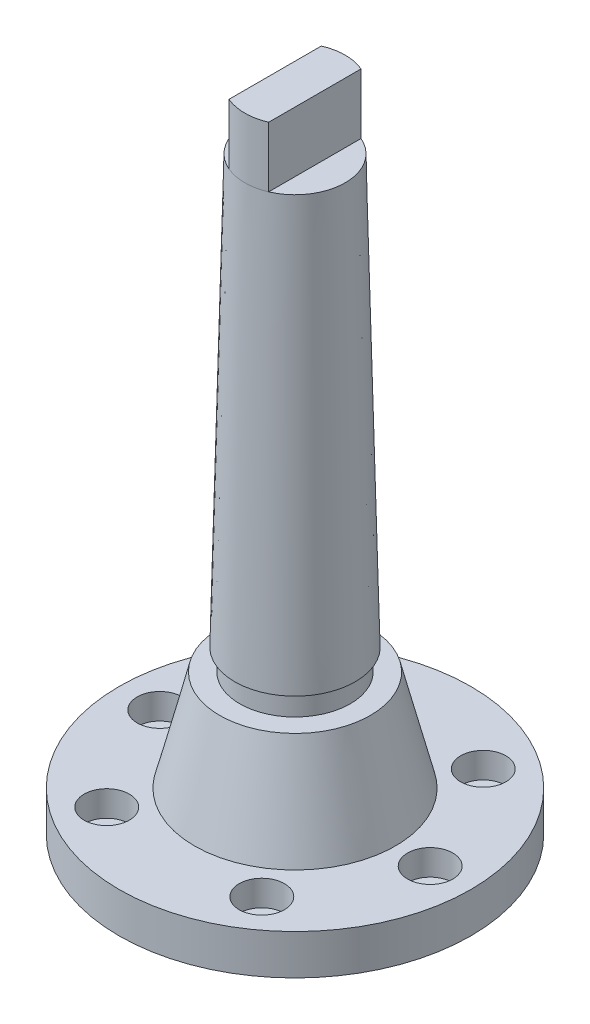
ISO-10303-21;
HEADER;
FILE_DESCRIPTION(('STEP AP214'),'2;1');
FILE_NAME('part.step','',(''),(''),'','','');
FILE_SCHEMA(('AUTOMOTIVE_DESIGN { 1 0 10303 214 1 1 1 1 }'));
ENDSEC;
DATA;
#1=APPLICATION_CONTEXT('core data for automotive mechanical design processes');
#2=APPLICATION_PROTOCOL_DEFINITION('international standard','automotive_design',2000,#1);
#3=PRODUCT_CONTEXT('',#1,'mechanical');
#4=PRODUCT('Part','Part','',(#3));
#5=PRODUCT_RELATED_PRODUCT_CATEGORY('part','',(#4));
#6=PRODUCT_DEFINITION_FORMATION('','',#4);
#7=PRODUCT_DEFINITION_CONTEXT('part definition',#1,'design');
#8=PRODUCT_DEFINITION('design','',#6,#7);
#9=PRODUCT_DEFINITION_SHAPE('','',#8);
#10=(LENGTH_UNIT() NAMED_UNIT(*) SI_UNIT(.MILLI.,.METRE.));
#11=(NAMED_UNIT(*) PLANE_ANGLE_UNIT() SI_UNIT($,.RADIAN.));
#12=(NAMED_UNIT(*) SI_UNIT($,.STERADIAN.) SOLID_ANGLE_UNIT());
#13=UNCERTAINTY_MEASURE_WITH_UNIT(LENGTH_MEASURE(1.E-05),#10,'distance_accuracy_value','');
#14=(GEOMETRIC_REPRESENTATION_CONTEXT(3) GLOBAL_UNCERTAINTY_ASSIGNED_CONTEXT((#13)) GLOBAL_UNIT_ASSIGNED_CONTEXT((#10,
#11,#12)) REPRESENTATION_CONTEXT('',''));
#15=CARTESIAN_POINT('',(0.,0.,0.));
#16=DIRECTION('',(0.,0.,1.));
#17=DIRECTION('',(1.,0.,0.));
#18=AXIS2_PLACEMENT_3D('',#15,#16,#17);
#19=CARTESIAN_POINT('',(0.,125.3,0.));
#20=DIRECTION('',(0.,1.,0.));
#21=DIRECTION('',(0.,0.,1.));
#22=AXIS2_PLACEMENT_3D('',#19,#20,#21);
#23=PLANE('',#22);
#24=DIRECTION('',(0.,0.,1.));
#25=VECTOR('',#24,1.);
#26=CARTESIAN_POINT('',(-3.95,125.3,9.18681119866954));
#27=LINE('',#26,#25);
#28=CARTESIAN_POINT('',(-3.94999934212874,125.3,-9.1868132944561));
#29=VERTEX_POINT('',#28);
#30=CARTESIAN_POINT('',(-3.95000032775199,125.3,9.18681015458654));
#31=VERTEX_POINT('',#30);
#32=EDGE_CURVE('E72',#29,#31,#27,.T.);
#33=ORIENTED_EDGE('',*,*,#32,.F.);
#34=CARTESIAN_POINT('',(0.,125.3,0.));
#35=DIRECTION('',(0.,1.,0.));
#36=DIRECTION('',(0.,0.,1.));
#37=AXIS2_PLACEMENT_3D('',#34,#35,#36);
#38=CIRCLE('',#37,10.);
#39=EDGE_CURVE('E124',#29,#31,#38,.T.);
#40=ORIENTED_EDGE('',*,*,#39,.T.);
#41=EDGE_LOOP('',(#33,#40));
#42=FACE_BOUND('',#41,.T.);
#43=ADVANCED_FACE('F45',(#42),#23,.T.);
#44=CARTESIAN_POINT('',(0.,16.,0.));
#45=DIRECTION('',(0.,1.,0.));
#46=DIRECTION('',(0.,0.,1.));
#47=AXIS2_PLACEMENT_3D('',#44,#45,#46);
#48=PLANE('',#47);
#49=CARTESIAN_POINT('',(0.,16.,0.));
#50=DIRECTION('',(0.,1.,0.));
#51=DIRECTION('',(0.,0.,1.));
#52=AXIS2_PLACEMENT_3D('',#49,#50,#51);
#53=CIRCLE('',#52,35.);
#54=CARTESIAN_POINT('',(0.,16.,35.));
#55=VERTEX_POINT('',#54);
#56=EDGE_CURVE('E335',#55,#55,#53,.T.);
#57=ORIENTED_EDGE('',*,*,#56,.T.);
#58=EDGE_LOOP('',(#57));
#59=FACE_BOUND('',#58,.T.);
#60=CARTESIAN_POINT('',(-15.4292061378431,16.,-22.0351899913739));
#61=DIRECTION('',(0.,1.,0.));
#62=DIRECTION('',(0.,0.,1.));
#63=AXIS2_PLACEMENT_3D('',#60,#61,#62);
#64=CIRCLE('',#63,4.5);
#65=CARTESIAN_POINT('',(-15.4292061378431,16.,-17.5351899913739));
#66=VERTEX_POINT('',#65);
#67=EDGE_CURVE('E265',#66,#66,#64,.T.);
#68=ORIENTED_EDGE('',*,*,#67,.F.);
#69=EDGE_LOOP('',(#68));
#70=FACE_BOUND('',#69,.T.);
#71=CARTESIAN_POINT('',(15.4292061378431,16.,-22.0351899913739));
#72=DIRECTION('',(0.,1.,0.));
#73=DIRECTION('',(0.,0.,1.));
#74=AXIS2_PLACEMENT_3D('',#71,#72,#73);
#75=CIRCLE('',#74,4.5);
#76=CARTESIAN_POINT('',(15.4292061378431,16.,-17.5351899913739));
#77=VERTEX_POINT('',#76);
#78=EDGE_CURVE('E266',#77,#77,#75,.T.);
#79=ORIENTED_EDGE('',*,*,#78,.F.);
#80=EDGE_LOOP('',(#79));
#81=FACE_BOUND('',#80,.T.);
#82=CARTESIAN_POINT('',(26.9,16.,0.));
#83=DIRECTION('',(0.,1.,0.));
#84=DIRECTION('',(0.,0.,1.));
#85=AXIS2_PLACEMENT_3D('',#82,#83,#84);
#86=CIRCLE('',#85,4.5);
#87=CARTESIAN_POINT('',(26.9,16.,4.5));
#88=VERTEX_POINT('',#87);
#89=EDGE_CURVE('E274',#88,#88,#86,.T.);
#90=ORIENTED_EDGE('',*,*,#89,.F.);
#91=EDGE_LOOP('',(#90));
#92=FACE_BOUND('',#91,.T.);
#93=CARTESIAN_POINT('',(15.4292061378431,16.,22.0351899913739));
#94=DIRECTION('',(0.,1.,0.));
#95=DIRECTION('',(0.,0.,1.));
#96=AXIS2_PLACEMENT_3D('',#93,#94,#95);
#97=CIRCLE('',#96,4.5);
#98=CARTESIAN_POINT('',(15.4292061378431,16.,26.5351899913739));
#99=VERTEX_POINT('',#98);
#100=EDGE_CURVE('E282',#99,#99,#97,.T.);
#101=ORIENTED_EDGE('',*,*,#100,.F.);
#102=EDGE_LOOP('',(#101));
#103=FACE_BOUND('',#102,.T.);
#104=CARTESIAN_POINT('',(-15.4292061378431,16.,22.0351899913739));
#105=DIRECTION('',(0.,1.,0.));
#106=DIRECTION('',(0.,0.,1.));
#107=AXIS2_PLACEMENT_3D('',#104,#105,#106);
#108=CIRCLE('',#107,4.5);
#109=CARTESIAN_POINT('',(-15.4292061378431,16.,26.5351899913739));
#110=VERTEX_POINT('',#109);
#111=EDGE_CURVE('E290',#110,#110,#108,.T.);
#112=ORIENTED_EDGE('',*,*,#111,.F.);
#113=EDGE_LOOP('',(#112));
#114=FACE_BOUND('',#113,.T.);
#115=CARTESIAN_POINT('',(-26.9,16.,0.));
#116=DIRECTION('',(0.,1.,0.));
#117=DIRECTION('',(0.,0.,1.));
#118=AXIS2_PLACEMENT_3D('',#115,#116,#117);
#119=CIRCLE('',#118,4.5);
#120=CARTESIAN_POINT('',(-26.9,16.,4.5));
#121=VERTEX_POINT('',#120);
#122=EDGE_CURVE('E258',#121,#121,#119,.T.);
#123=ORIENTED_EDGE('',*,*,#122,.F.);
#124=EDGE_LOOP('',(#123));
#125=FACE_BOUND('',#124,.T.);
#126=CARTESIAN_POINT('',(0.,16.,0.));
#127=DIRECTION('',(0.,1.,0.));
#128=DIRECTION('',(0.,0.,1.));
#129=AXIS2_PLACEMENT_3D('',#126,#127,#128);
#130=CIRCLE('',#129,20.);
#131=CARTESIAN_POINT('',(0.,16.,20.));
#132=VERTEX_POINT('',#131);
#133=EDGE_CURVE('E216',#132,#132,#130,.T.);
#134=ORIENTED_EDGE('',*,*,#133,.F.);
#135=EDGE_LOOP('',(#134));
#136=FACE_BOUND('',#135,.T.);
#137=ADVANCED_FACE('F376',(#59,#70,#81,#92,#103,#114,#125,#136),#48,.T.);
#138=CARTESIAN_POINT('',(-15.4292061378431,-0.001000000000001,-22.0351899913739));
#139=DIRECTION('',(0.,1.,0.));
#140=DIRECTION('',(0.,0.,1.));
#141=AXIS2_PLACEMENT_3D('',#138,#139,#140);
#142=CYLINDRICAL_SURFACE('',#141,2.7);
#143=CARTESIAN_POINT('',(-15.4292061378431,8.,-22.0351899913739));
#144=DIRECTION('',(0.,1.,0.));
#145=DIRECTION('',(0.,0.,1.));
#146=AXIS2_PLACEMENT_3D('',#143,#144,#145);
#147=CIRCLE('',#146,2.7);
#148=CARTESIAN_POINT('',(-15.4292061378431,8.,-19.3351899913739));
#149=VERTEX_POINT('',#148);
#150=EDGE_CURVE('E314',#149,#149,#147,.F.);
#151=ORIENTED_EDGE('',*,*,#150,.T.);
#152=EDGE_LOOP('',(#151));
#153=FACE_BOUND('',#152,.T.);
#154=CARTESIAN_POINT('',(-15.4292061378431,10.9,-22.0351899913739));
#155=DIRECTION('',(0.,1.,0.));
#156=DIRECTION('',(0.,0.,1.));
#157=AXIS2_PLACEMENT_3D('',#154,#155,#156);
#158=CIRCLE('',#157,2.7);
#159=CARTESIAN_POINT('',(-15.4292061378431,10.9,-19.3351899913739));
#160=VERTEX_POINT('',#159);
#161=EDGE_CURVE('E320',#160,#160,#158,.F.);
#162=ORIENTED_EDGE('',*,*,#161,.F.);
#163=EDGE_LOOP('',(#162));
#164=FACE_BOUND('',#163,.T.);
#165=ADVANCED_FACE('F373',(#153,#164),#142,.F.);
#166=CARTESIAN_POINT('',(15.4292061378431,-0.001000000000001,-22.0351899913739));
#167=DIRECTION('',(0.,1.,0.));
#168=DIRECTION('',(0.,0.,1.));
#169=AXIS2_PLACEMENT_3D('',#166,#167,#168);
#170=CYLINDRICAL_SURFACE('',#169,2.7);
#171=CARTESIAN_POINT('',(15.4292061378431,8.,-22.0351899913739));
#172=DIRECTION('',(0.,1.,0.));
#173=DIRECTION('',(0.,0.,1.));
#174=AXIS2_PLACEMENT_3D('',#171,#172,#173);
#175=CIRCLE('',#174,2.7);
#176=CARTESIAN_POINT('',(15.4292061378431,8.,-19.3351899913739));
#177=VERTEX_POINT('',#176);
#178=EDGE_CURVE('E324',#177,#177,#175,.F.);
#179=ORIENTED_EDGE('',*,*,#178,.T.);
#180=EDGE_LOOP('',(#179));
#181=FACE_BOUND('',#180,.T.);
#182=CARTESIAN_POINT('',(15.4292061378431,10.9,-22.0351899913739));
#183=DIRECTION('',(0.,1.,0.));
#184=DIRECTION('',(0.,0.,1.));
#185=AXIS2_PLACEMENT_3D('',#182,#183,#184);
#186=CIRCLE('',#185,2.7);
#187=CARTESIAN_POINT('',(15.4292061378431,10.9,-19.3351899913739));
#188=VERTEX_POINT('',#187);
#189=EDGE_CURVE('E364',#188,#188,#186,.F.);
#190=ORIENTED_EDGE('',*,*,#189,.F.);
#191=EDGE_LOOP('',(#190));
#192=FACE_BOUND('',#191,.T.);
#193=ADVANCED_FACE('F375',(#181,#192),#170,.F.);
#194=CARTESIAN_POINT('',(26.9,-0.001000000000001,0.));
#195=DIRECTION('',(0.,1.,0.));
#196=DIRECTION('',(0.,0.,1.));
#197=AXIS2_PLACEMENT_3D('',#194,#195,#196);
#198=CYLINDRICAL_SURFACE('',#197,2.7);
#199=CARTESIAN_POINT('',(26.9,8.,0.));
#200=DIRECTION('',(0.,1.,0.));
#201=DIRECTION('',(0.,0.,1.));
#202=AXIS2_PLACEMENT_3D('',#199,#200,#201);
#203=CIRCLE('',#202,2.7);
#204=CARTESIAN_POINT('',(26.9,8.,2.7));
#205=VERTEX_POINT('',#204);
#206=EDGE_CURVE('E328',#205,#205,#203,.F.);
#207=ORIENTED_EDGE('',*,*,#206,.T.);
#208=EDGE_LOOP('',(#207));
#209=FACE_BOUND('',#208,.T.);
#210=CARTESIAN_POINT('',(26.9,10.9,0.));
#211=DIRECTION('',(0.,1.,0.));
#212=DIRECTION('',(0.,0.,1.));
#213=AXIS2_PLACEMENT_3D('',#210,#211,#212);
#214=CIRCLE('',#213,2.7);
#215=CARTESIAN_POINT('',(26.9,10.9,2.7));
#216=VERTEX_POINT('',#215);
#217=EDGE_CURVE('E360',#216,#216,#214,.F.);
#218=ORIENTED_EDGE('',*,*,#217,.F.);
#219=EDGE_LOOP('',(#218));
#220=FACE_BOUND('',#219,.T.);
#221=ADVANCED_FACE('F383',(#209,#220),#198,.F.);
#222=CARTESIAN_POINT('',(15.4292061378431,-0.001000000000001,22.0351899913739));
#223=DIRECTION('',(0.,1.,0.));
#224=DIRECTION('',(0.,0.,1.));
#225=AXIS2_PLACEMENT_3D('',#222,#223,#224);
#226=CYLINDRICAL_SURFACE('',#225,2.7);
#227=CARTESIAN_POINT('',(15.4292061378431,8.,22.0351899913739));
#228=DIRECTION('',(0.,1.,0.));
#229=DIRECTION('',(0.,0.,1.));
#230=AXIS2_PLACEMENT_3D('',#227,#228,#229);
#231=CIRCLE('',#230,2.7);
#232=CARTESIAN_POINT('',(15.4292061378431,8.,24.7351899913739));
#233=VERTEX_POINT('',#232);
#234=EDGE_CURVE('E319',#233,#233,#231,.F.);
#235=ORIENTED_EDGE('',*,*,#234,.T.);
#236=EDGE_LOOP('',(#235));
#237=FACE_BOUND('',#236,.T.);
#238=CARTESIAN_POINT('',(15.4292061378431,10.9,22.0351899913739));
#239=DIRECTION('',(0.,1.,0.));
#240=DIRECTION('',(0.,0.,1.));
#241=AXIS2_PLACEMENT_3D('',#238,#239,#240);
#242=CIRCLE('',#241,2.7);
#243=CARTESIAN_POINT('',(15.4292061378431,10.9,24.7351899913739));
#244=VERTEX_POINT('',#243);
#245=EDGE_CURVE('E356',#244,#244,#242,.F.);
#246=ORIENTED_EDGE('',*,*,#245,.F.);
#247=EDGE_LOOP('',(#246));
#248=FACE_BOUND('',#247,.T.);
#249=ADVANCED_FACE('F559',(#237,#248),#226,.F.);
#250=CARTESIAN_POINT('',(-15.4292061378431,-0.001000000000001,22.0351899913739));
#251=DIRECTION('',(0.,1.,0.));
#252=DIRECTION('',(0.,0.,1.));
#253=AXIS2_PLACEMENT_3D('',#250,#251,#252);
#254=CYLINDRICAL_SURFACE('',#253,2.7);
#255=CARTESIAN_POINT('',(-15.4292061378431,8.,22.0351899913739));
#256=DIRECTION('',(0.,1.,0.));
#257=DIRECTION('',(0.,0.,1.));
#258=AXIS2_PLACEMENT_3D('',#255,#256,#257);
#259=CIRCLE('',#258,2.7);
#260=CARTESIAN_POINT('',(-15.4292061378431,8.,24.7351899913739));
#261=VERTEX_POINT('',#260);
#262=EDGE_CURVE('E315',#261,#261,#259,.F.);
#263=ORIENTED_EDGE('',*,*,#262,.T.);
#264=EDGE_LOOP('',(#263));
#265=FACE_BOUND('',#264,.T.);
#266=CARTESIAN_POINT('',(-15.4292061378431,10.9,22.0351899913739));
#267=DIRECTION('',(0.,1.,0.));
#268=DIRECTION('',(0.,0.,1.));
#269=AXIS2_PLACEMENT_3D('',#266,#267,#268);
#270=CIRCLE('',#269,2.7);
#271=CARTESIAN_POINT('',(-15.4292061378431,10.9,24.7351899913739));
#272=VERTEX_POINT('',#271);
#273=EDGE_CURVE('E352',#272,#272,#270,.F.);
#274=ORIENTED_EDGE('',*,*,#273,.F.);
#275=EDGE_LOOP('',(#274));
#276=FACE_BOUND('',#275,.T.);
#277=ADVANCED_FACE('F551',(#265,#276),#254,.F.);
#278=CARTESIAN_POINT('',(-26.9,-0.001000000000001,0.));
#279=DIRECTION('',(0.,1.,0.));
#280=DIRECTION('',(0.,0.,1.));
#281=AXIS2_PLACEMENT_3D('',#278,#279,#280);
#282=CYLINDRICAL_SURFACE('',#281,2.7);
#283=CARTESIAN_POINT('',(-26.9,8.,0.));
#284=DIRECTION('',(0.,1.,0.));
#285=DIRECTION('',(0.,0.,1.));
#286=AXIS2_PLACEMENT_3D('',#283,#284,#285);
#287=CIRCLE('',#286,2.7);
#288=CARTESIAN_POINT('',(-26.9,8.,2.7));
#289=VERTEX_POINT('',#288);
#290=EDGE_CURVE('E309',#289,#289,#287,.F.);
#291=ORIENTED_EDGE('',*,*,#290,.T.);
#292=EDGE_LOOP('',(#291));
#293=FACE_BOUND('',#292,.T.);
#294=CARTESIAN_POINT('',(-26.9,10.9,0.));
#295=DIRECTION('',(0.,1.,0.));
#296=DIRECTION('',(0.,0.,1.));
#297=AXIS2_PLACEMENT_3D('',#294,#295,#296);
#298=CIRCLE('',#297,2.7);
#299=CARTESIAN_POINT('',(-26.9,10.9,2.7));
#300=VERTEX_POINT('',#299);
#301=EDGE_CURVE('E305',#300,#300,#298,.F.);
#302=ORIENTED_EDGE('',*,*,#301,.F.);
#303=EDGE_LOOP('',(#302));
#304=FACE_BOUND('',#303,.T.);
#305=ADVANCED_FACE('F545',(#293,#304),#282,.F.);
#306=CARTESIAN_POINT('',(0.,8.,0.));
#307=DIRECTION('',(0.,-1.,0.));
#308=DIRECTION('',(0.,0.,-1.));
#309=AXIS2_PLACEMENT_3D('',#306,#307,#308);
#310=CYLINDRICAL_SURFACE('',#309,17.95);
#311=CARTESIAN_POINT('',(0.,8.,0.));
#312=DIRECTION('',(0.,1.,0.));
#313=DIRECTION('',(0.,0.,1.));
#314=AXIS2_PLACEMENT_3D('',#311,#312,#313);
#315=CIRCLE('',#314,17.95);
#316=CARTESIAN_POINT('',(0.,8.,17.95));
#317=VERTEX_POINT('',#316);
#318=EDGE_CURVE('E57',#317,#317,#315,.T.);
#319=ORIENTED_EDGE('',*,*,#318,.F.);
#320=EDGE_LOOP('',(#319));
#321=FACE_BOUND('',#320,.T.);
#322=CARTESIAN_POINT('',(0.,0.,0.));
#323=DIRECTION('',(0.,1.,0.));
#324=DIRECTION('',(0.,0.,1.));
#325=AXIS2_PLACEMENT_3D('',#322,#323,#324);
#326=CIRCLE('',#325,17.95);
#327=CARTESIAN_POINT('',(0.,0.,17.95));
#328=VERTEX_POINT('',#327);
#329=EDGE_CURVE('E339',#328,#328,#326,.T.);
#330=ORIENTED_EDGE('',*,*,#329,.T.);
#331=EDGE_LOOP('',(#330));
#332=FACE_BOUND('',#331,.T.);
#333=ADVANCED_FACE('F47',(#321,#332),#310,.T.);
#334=CARTESIAN_POINT('',(0.,0.,0.));
#335=DIRECTION('',(0.,1.,0.));
#336=DIRECTION('',(0.,0.,1.));
#337=AXIS2_PLACEMENT_3D('',#334,#335,#336);
#338=PLANE('',#337);
#339=ORIENTED_EDGE('',*,*,#329,.F.);
#340=EDGE_LOOP('',(#339));
#341=FACE_BOUND('',#340,.T.);
#342=ADVANCED_FACE('F531',(#341),#338,.F.);
#343=CARTESIAN_POINT('',(0.,16.,0.));
#344=DIRECTION('',(0.,-1.,0.));
#345=DIRECTION('',(0.,0.,-1.));
#346=AXIS2_PLACEMENT_3D('',#343,#344,#345);
#347=CYLINDRICAL_SURFACE('',#346,35.);
#348=ORIENTED_EDGE('',*,*,#56,.F.);
#349=EDGE_LOOP('',(#348));
#350=FACE_BOUND('',#349,.T.);
#351=CARTESIAN_POINT('',(0.,8.,0.));
#352=DIRECTION('',(0.,1.,0.));
#353=DIRECTION('',(0.,0.,1.));
#354=AXIS2_PLACEMENT_3D('',#351,#352,#353);
#355=CIRCLE('',#354,35.);
#356=CARTESIAN_POINT('',(0.,8.,35.));
#357=VERTEX_POINT('',#356);
#358=EDGE_CURVE('E313',#357,#357,#355,.T.);
#359=ORIENTED_EDGE('',*,*,#358,.T.);
#360=EDGE_LOOP('',(#359));
#361=FACE_BOUND('',#360,.T.);
#362=ADVANCED_FACE('F523',(#350,#361),#347,.T.);
#363=CARTESIAN_POINT('',(0.,8.,0.));
#364=DIRECTION('',(0.,1.,0.));
#365=DIRECTION('',(0.,0.,1.));
#366=AXIS2_PLACEMENT_3D('',#363,#364,#365);
#367=PLANE('',#366);
#368=ORIENTED_EDGE('',*,*,#290,.F.);
#369=EDGE_LOOP('',(#368));
#370=FACE_BOUND('',#369,.T.);
#371=ORIENTED_EDGE('',*,*,#262,.F.);
#372=EDGE_LOOP('',(#371));
#373=FACE_BOUND('',#372,.T.);
#374=ORIENTED_EDGE('',*,*,#234,.F.);
#375=EDGE_LOOP('',(#374));
#376=FACE_BOUND('',#375,.T.);
#377=ORIENTED_EDGE('',*,*,#206,.F.);
#378=EDGE_LOOP('',(#377));
#379=FACE_BOUND('',#378,.T.);
#380=ORIENTED_EDGE('',*,*,#178,.F.);
#381=EDGE_LOOP('',(#380));
#382=FACE_BOUND('',#381,.T.);
#383=ORIENTED_EDGE('',*,*,#150,.F.);
#384=EDGE_LOOP('',(#383));
#385=FACE_BOUND('',#384,.T.);
#386=ORIENTED_EDGE('',*,*,#318,.T.);
#387=EDGE_LOOP('',(#386));
#388=FACE_BOUND('',#387,.T.);
#389=ORIENTED_EDGE('',*,*,#358,.F.);
#390=EDGE_LOOP('',(#389));
#391=FACE_BOUND('',#390,.T.);
#392=ADVANCED_FACE('F514',(#370,#373,#376,#379,#382,#385,#388,#391),#367,.F.);
#393=CARTESIAN_POINT('',(-26.9,10.9,0.));
#394=DIRECTION('',(0.,1.,0.));
#395=DIRECTION('',(0.,0.,1.));
#396=AXIS2_PLACEMENT_3D('',#393,#394,#395);
#397=PLANE('',#396);
#398=CARTESIAN_POINT('',(-26.9,10.9,0.));
#399=DIRECTION('',(0.,1.,0.));
#400=DIRECTION('',(0.,0.,1.));
#401=AXIS2_PLACEMENT_3D('',#398,#399,#400);
#402=CIRCLE('',#401,4.5);
#403=CARTESIAN_POINT('',(-26.9,10.9,4.5));
#404=VERTEX_POINT('',#403);
#405=EDGE_CURVE('E294',#404,#404,#402,.T.);
#406=ORIENTED_EDGE('',*,*,#405,.T.);
#407=EDGE_LOOP('',(#406));
#408=FACE_BOUND('',#407,.T.);
#409=ORIENTED_EDGE('',*,*,#301,.T.);
#410=EDGE_LOOP('',(#409));
#411=FACE_BOUND('',#410,.T.);
#412=ADVANCED_FACE('F506',(#408,#411),#397,.T.);
#413=CARTESIAN_POINT('',(-26.9,10.9,0.));
#414=DIRECTION('',(0.,1.,0.));
#415=DIRECTION('',(0.,0.,1.));
#416=AXIS2_PLACEMENT_3D('',#413,#414,#415);
#417=CYLINDRICAL_SURFACE('',#416,4.5);
#418=ORIENTED_EDGE('',*,*,#405,.F.);
#419=EDGE_LOOP('',(#418));
#420=FACE_BOUND('',#419,.T.);
#421=ORIENTED_EDGE('',*,*,#122,.T.);
#422=EDGE_LOOP('',(#421));
#423=FACE_BOUND('',#422,.T.);
#424=ADVANCED_FACE('F498',(#420,#423),#417,.F.);
#425=CARTESIAN_POINT('',(-15.4292061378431,10.9,22.0351899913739));
#426=DIRECTION('',(0.,1.,0.));
#427=DIRECTION('',(0.,0.,1.));
#428=AXIS2_PLACEMENT_3D('',#425,#426,#427);
#429=PLANE('',#428);
#430=CARTESIAN_POINT('',(-15.4292061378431,10.9,22.0351899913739));
#431=DIRECTION('',(0.,1.,0.));
#432=DIRECTION('',(0.,0.,1.));
#433=AXIS2_PLACEMENT_3D('',#430,#431,#432);
#434=CIRCLE('',#433,4.5);
#435=CARTESIAN_POINT('',(-15.4292061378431,10.9,26.5351899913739));
#436=VERTEX_POINT('',#435);
#437=EDGE_CURVE('E286',#436,#436,#434,.T.);
#438=ORIENTED_EDGE('',*,*,#437,.T.);
#439=EDGE_LOOP('',(#438));
#440=FACE_BOUND('',#439,.T.);
#441=ORIENTED_EDGE('',*,*,#273,.T.);
#442=EDGE_LOOP('',(#441));
#443=FACE_BOUND('',#442,.T.);
#444=ADVANCED_FACE('F490',(#440,#443),#429,.T.);
#445=CARTESIAN_POINT('',(-15.4292061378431,10.9,22.0351899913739));
#446=DIRECTION('',(0.,1.,0.));
#447=DIRECTION('',(0.,0.,1.));
#448=AXIS2_PLACEMENT_3D('',#445,#446,#447);
#449=CYLINDRICAL_SURFACE('',#448,4.5);
#450=ORIENTED_EDGE('',*,*,#437,.F.);
#451=EDGE_LOOP('',(#450));
#452=FACE_BOUND('',#451,.T.);
#453=ORIENTED_EDGE('',*,*,#111,.T.);
#454=EDGE_LOOP('',(#453));
#455=FACE_BOUND('',#454,.T.);
#456=ADVANCED_FACE('F482',(#452,#455),#449,.F.);
#457=CARTESIAN_POINT('',(15.4292061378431,10.9,22.0351899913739));
#458=DIRECTION('',(0.,1.,0.));
#459=DIRECTION('',(0.,0.,1.));
#460=AXIS2_PLACEMENT_3D('',#457,#458,#459);
#461=PLANE('',#460);
#462=CARTESIAN_POINT('',(15.4292061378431,10.9,22.0351899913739));
#463=DIRECTION('',(0.,1.,0.));
#464=DIRECTION('',(0.,0.,1.));
#465=AXIS2_PLACEMENT_3D('',#462,#463,#464);
#466=CIRCLE('',#465,4.5);
#467=CARTESIAN_POINT('',(15.4292061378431,10.9,26.5351899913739));
#468=VERTEX_POINT('',#467);
#469=EDGE_CURVE('E278',#468,#468,#466,.T.);
#470=ORIENTED_EDGE('',*,*,#469,.T.);
#471=EDGE_LOOP('',(#470));
#472=FACE_BOUND('',#471,.T.);
#473=ORIENTED_EDGE('',*,*,#245,.T.);
#474=EDGE_LOOP('',(#473));
#475=FACE_BOUND('',#474,.T.);
#476=ADVANCED_FACE('F474',(#472,#475),#461,.T.);
#477=CARTESIAN_POINT('',(15.4292061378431,10.9,22.0351899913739));
#478=DIRECTION('',(0.,1.,0.));
#479=DIRECTION('',(0.,0.,1.));
#480=AXIS2_PLACEMENT_3D('',#477,#478,#479);
#481=CYLINDRICAL_SURFACE('',#480,4.5);
#482=ORIENTED_EDGE('',*,*,#469,.F.);
#483=EDGE_LOOP('',(#482));
#484=FACE_BOUND('',#483,.T.);
#485=ORIENTED_EDGE('',*,*,#100,.T.);
#486=EDGE_LOOP('',(#485));
#487=FACE_BOUND('',#486,.T.);
#488=ADVANCED_FACE('F466',(#484,#487),#481,.F.);
#489=CARTESIAN_POINT('',(26.9,10.9,0.));
#490=DIRECTION('',(0.,1.,0.));
#491=DIRECTION('',(0.,0.,1.));
#492=AXIS2_PLACEMENT_3D('',#489,#490,#491);
#493=PLANE('',#492);
#494=CARTESIAN_POINT('',(26.9,10.9,0.));
#495=DIRECTION('',(0.,1.,0.));
#496=DIRECTION('',(0.,0.,1.));
#497=AXIS2_PLACEMENT_3D('',#494,#495,#496);
#498=CIRCLE('',#497,4.5);
#499=CARTESIAN_POINT('',(26.9,10.9,4.5));
#500=VERTEX_POINT('',#499);
#501=EDGE_CURVE('E270',#500,#500,#498,.T.);
#502=ORIENTED_EDGE('',*,*,#501,.T.);
#503=EDGE_LOOP('',(#502));
#504=FACE_BOUND('',#503,.T.);
#505=ORIENTED_EDGE('',*,*,#217,.T.);
#506=EDGE_LOOP('',(#505));
#507=FACE_BOUND('',#506,.T.);
#508=ADVANCED_FACE('F458',(#504,#507),#493,.T.);
#509=CARTESIAN_POINT('',(26.9,10.9,0.));
#510=DIRECTION('',(0.,1.,0.));
#511=DIRECTION('',(0.,0.,1.));
#512=AXIS2_PLACEMENT_3D('',#509,#510,#511);
#513=CYLINDRICAL_SURFACE('',#512,4.5);
#514=ORIENTED_EDGE('',*,*,#501,.F.);
#515=EDGE_LOOP('',(#514));
#516=FACE_BOUND('',#515,.T.);
#517=ORIENTED_EDGE('',*,*,#89,.T.);
#518=EDGE_LOOP('',(#517));
#519=FACE_BOUND('',#518,.T.);
#520=ADVANCED_FACE('F451',(#516,#519),#513,.F.);
#521=CARTESIAN_POINT('',(15.4292061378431,10.9,-22.0351899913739));
#522=DIRECTION('',(0.,1.,0.));
#523=DIRECTION('',(0.,0.,1.));
#524=AXIS2_PLACEMENT_3D('',#521,#522,#523);
#525=PLANE('',#524);
#526=CARTESIAN_POINT('',(15.4292061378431,10.9,-22.0351899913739));
#527=DIRECTION('',(0.,1.,0.));
#528=DIRECTION('',(0.,0.,1.));
#529=AXIS2_PLACEMENT_3D('',#526,#527,#528);
#530=CIRCLE('',#529,4.5);
#531=CARTESIAN_POINT('',(15.4292061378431,10.9,-17.5351899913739));
#532=VERTEX_POINT('',#531);
#533=EDGE_CURVE('E261',#532,#532,#530,.T.);
#534=ORIENTED_EDGE('',*,*,#533,.T.);
#535=EDGE_LOOP('',(#534));
#536=FACE_BOUND('',#535,.T.);
#537=ORIENTED_EDGE('',*,*,#189,.T.);
#538=EDGE_LOOP('',(#537));
#539=FACE_BOUND('',#538,.T.);
#540=ADVANCED_FACE('F245',(#536,#539),#525,.T.);
#541=CARTESIAN_POINT('',(15.4292061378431,10.9,-22.0351899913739));
#542=DIRECTION('',(0.,1.,0.));
#543=DIRECTION('',(0.,0.,1.));
#544=AXIS2_PLACEMENT_3D('',#541,#542,#543);
#545=CYLINDRICAL_SURFACE('',#544,4.5);
#546=ORIENTED_EDGE('',*,*,#533,.F.);
#547=EDGE_LOOP('',(#546));
#548=FACE_BOUND('',#547,.T.);
#549=ORIENTED_EDGE('',*,*,#78,.T.);
#550=EDGE_LOOP('',(#549));
#551=FACE_BOUND('',#550,.T.);
#552=ADVANCED_FACE('F437',(#548,#551),#545,.F.);
#553=CARTESIAN_POINT('',(-15.4292061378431,10.9,-22.0351899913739));
#554=DIRECTION('',(0.,1.,0.));
#555=DIRECTION('',(0.,0.,1.));
#556=AXIS2_PLACEMENT_3D('',#553,#554,#555);
#557=PLANE('',#556);
#558=CARTESIAN_POINT('',(-15.4292061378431,10.9,-22.0351899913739));
#559=DIRECTION('',(0.,1.,0.));
#560=DIRECTION('',(0.,0.,1.));
#561=AXIS2_PLACEMENT_3D('',#558,#559,#560);
#562=CIRCLE('',#561,4.5);
#563=CARTESIAN_POINT('',(-15.4292061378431,10.9,-17.5351899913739));
#564=VERTEX_POINT('',#563);
#565=EDGE_CURVE('E301',#564,#564,#562,.T.);
#566=ORIENTED_EDGE('',*,*,#565,.T.);
#567=EDGE_LOOP('',(#566));
#568=FACE_BOUND('',#567,.T.);
#569=ORIENTED_EDGE('',*,*,#161,.T.);
#570=EDGE_LOOP('',(#569));
#571=FACE_BOUND('',#570,.T.);
#572=ADVANCED_FACE('F371',(#568,#571),#557,.T.);
#573=CARTESIAN_POINT('',(-15.4292061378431,10.9,-22.0351899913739));
#574=DIRECTION('',(0.,1.,0.));
#575=DIRECTION('',(0.,0.,1.));
#576=AXIS2_PLACEMENT_3D('',#573,#574,#575);
#577=CYLINDRICAL_SURFACE('',#576,4.5);
#578=ORIENTED_EDGE('',*,*,#565,.F.);
#579=EDGE_LOOP('',(#578));
#580=FACE_BOUND('',#579,.T.);
#581=ORIENTED_EDGE('',*,*,#67,.T.);
#582=EDGE_LOOP('',(#581));
#583=FACE_BOUND('',#582,.T.);
#584=ADVANCED_FACE('F243',(#580,#583),#577,.F.);
#585=CARTESIAN_POINT('',(0.,36.,0.));
#586=DIRECTION('',(0.,-1.,0.));
#587=DIRECTION('',(0.,0.,-1.));
#588=AXIS2_PLACEMENT_3D('',#585,#586,#587);
#589=PLANE('',#588);
#590=CARTESIAN_POINT('',(0.,36.,0.));
#591=DIRECTION('',(0.,1.,0.));
#592=DIRECTION('',(0.,0.,1.));
#593=AXIS2_PLACEMENT_3D('',#590,#591,#592);
#594=CIRCLE('',#593,11.);
#595=CARTESIAN_POINT('',(0.,36.,-11.));
#596=VERTEX_POINT('',#595);
#597=EDGE_CURVE('E12',#596,#596,#594,.T.);
#598=ORIENTED_EDGE('',*,*,#597,.F.);
#599=EDGE_LOOP('',(#598));
#600=FACE_BOUND('',#599,.T.);
#601=CARTESIAN_POINT('',(0.,36.,0.));
#602=DIRECTION('',(0.,-1.,0.));
#603=DIRECTION('',(0.,0.,-1.));
#604=AXIS2_PLACEMENT_3D('',#601,#602,#603);
#605=CIRCLE('',#604,15.);
#606=CARTESIAN_POINT('',(0.,36.,-15.));
#607=VERTEX_POINT('',#606);
#608=EDGE_CURVE('E222',#607,#607,#605,.T.);
#609=ORIENTED_EDGE('',*,*,#608,.F.);
#610=EDGE_LOOP('',(#609));
#611=FACE_BOUND('',#610,.T.);
#612=ADVANCED_FACE('F238',(#600,#611),#589,.F.);
#613=CARTESIAN_POINT('',(0.,36.,0.));
#614=DIRECTION('',(0.,-1.,0.));
#615=DIRECTION('',(0.,0.,-1.));
#616=AXIS2_PLACEMENT_3D('',#613,#614,#615);
#617=CONICAL_SURFACE('',#616,15.,0.244978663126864);
#618=ORIENTED_EDGE('',*,*,#133,.T.);
#619=EDGE_LOOP('',(#618));
#620=FACE_BOUND('',#619,.T.);
#621=ORIENTED_EDGE('',*,*,#608,.T.);
#622=EDGE_LOOP('',(#621));
#623=FACE_BOUND('',#622,.T.);
#624=ADVANCED_FACE('F228',(#620,#623),#617,.T.);
#625=CARTESIAN_POINT('',(0.,40.3,0.));
#626=DIRECTION('',(0.,-1.,0.));
#627=DIRECTION('',(0.,0.,-1.));
#628=AXIS2_PLACEMENT_3D('',#625,#626,#627);
#629=CYLINDRICAL_SURFACE('',#628,11.);
#630=CARTESIAN_POINT('',(0.,40.3,0.));
#631=DIRECTION('',(0.,1.,0.));
#632=DIRECTION('',(0.,0.,1.));
#633=AXIS2_PLACEMENT_3D('',#630,#631,#632);
#634=CIRCLE('',#633,11.);
#635=CARTESIAN_POINT('',(0.,40.3,-11.));
#636=VERTEX_POINT('',#635);
#637=EDGE_CURVE('E212',#636,#636,#634,.T.);
#638=CARTESIAN_POINT('',(0.,40.3,-11.));
#639=CARTESIAN_POINT('',(0.,40.2552083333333,-11.));
#640=CARTESIAN_POINT('',(0.,40.2104166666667,-11.));
#641=CARTESIAN_POINT('',(0.,40.1208333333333,-11.));
#642=CARTESIAN_POINT('',(0.,40.0760416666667,-11.));
#643=CARTESIAN_POINT('',(0.,39.9864583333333,-11.));
#644=CARTESIAN_POINT('',(0.,39.9416666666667,-11.));
#645=CARTESIAN_POINT('',(0.,39.8520833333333,-11.));
#646=CARTESIAN_POINT('',(0.,39.8072916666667,-11.));
#647=CARTESIAN_POINT('',(0.,39.7177083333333,-11.));
#648=CARTESIAN_POINT('',(0.,39.6729166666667,-11.));
#649=CARTESIAN_POINT('',(0.,39.5833333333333,-11.));
#650=CARTESIAN_POINT('',(0.,39.5385416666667,-11.));
#651=CARTESIAN_POINT('',(0.,39.4489583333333,-11.));
#652=CARTESIAN_POINT('',(0.,39.4041666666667,-11.));
#653=CARTESIAN_POINT('',(0.,39.3145833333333,-11.));
#654=CARTESIAN_POINT('',(0.,39.2697916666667,-11.));
#655=CARTESIAN_POINT('',(0.,39.1802083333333,-11.));
#656=CARTESIAN_POINT('',(0.,39.1354166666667,-11.));
#657=CARTESIAN_POINT('',(0.,39.0458333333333,-11.));
#658=CARTESIAN_POINT('',(0.,39.0010416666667,-11.));
#659=CARTESIAN_POINT('',(0.,38.9114583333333,-11.));
#660=CARTESIAN_POINT('',(0.,38.8666666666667,-11.));
#661=CARTESIAN_POINT('',(0.,38.7770833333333,-11.));
#662=CARTESIAN_POINT('',(0.,38.7322916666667,-11.));
#663=CARTESIAN_POINT('',(0.,38.6427083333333,-11.));
#664=CARTESIAN_POINT('',(0.,38.5979166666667,-11.));
#665=CARTESIAN_POINT('',(0.,38.5083333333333,-11.));
#666=CARTESIAN_POINT('',(0.,38.4635416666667,-11.));
#667=CARTESIAN_POINT('',(0.,38.3739583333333,-11.));
#668=CARTESIAN_POINT('',(0.,38.3291666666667,-11.));
#669=CARTESIAN_POINT('',(0.,38.2395833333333,-11.));
#670=CARTESIAN_POINT('',(0.,38.1947916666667,-11.));
#671=CARTESIAN_POINT('',(0.,38.1052083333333,-11.));
#672=CARTESIAN_POINT('',(0.,38.0604166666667,-11.));
#673=CARTESIAN_POINT('',(0.,37.9708333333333,-11.));
#674=CARTESIAN_POINT('',(0.,37.9260416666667,-11.));
#675=CARTESIAN_POINT('',(0.,37.8364583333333,-11.));
#676=CARTESIAN_POINT('',(0.,37.7916666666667,-11.));
#677=CARTESIAN_POINT('',(0.,37.7020833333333,-11.));
#678=CARTESIAN_POINT('',(0.,37.6572916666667,-11.));
#679=CARTESIAN_POINT('',(0.,37.5677083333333,-11.));
#680=CARTESIAN_POINT('',(0.,37.5229166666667,-11.));
#681=CARTESIAN_POINT('',(0.,37.4333333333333,-11.));
#682=CARTESIAN_POINT('',(0.,37.3885416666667,-11.));
#683=CARTESIAN_POINT('',(0.,37.2989583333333,-11.));
#684=CARTESIAN_POINT('',(0.,37.2541666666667,-11.));
#685=CARTESIAN_POINT('',(0.,37.1645833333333,-11.));
#686=CARTESIAN_POINT('',(0.,37.1197916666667,-11.));
#687=CARTESIAN_POINT('',(0.,37.0302083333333,-11.));
#688=CARTESIAN_POINT('',(0.,36.9854166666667,-11.));
#689=CARTESIAN_POINT('',(0.,36.8958333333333,-11.));
#690=CARTESIAN_POINT('',(0.,36.8510416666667,-11.));
#691=CARTESIAN_POINT('',(0.,36.7614583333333,-11.));
#692=CARTESIAN_POINT('',(0.,36.7166666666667,-11.));
#693=CARTESIAN_POINT('',(0.,36.6270833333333,-11.));
#694=CARTESIAN_POINT('',(0.,36.5822916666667,-11.));
#695=CARTESIAN_POINT('',(0.,36.4927083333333,-11.));
#696=CARTESIAN_POINT('',(0.,36.4479166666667,-11.));
#697=CARTESIAN_POINT('',(0.,36.3583333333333,-11.));
#698=CARTESIAN_POINT('',(0.,36.3135416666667,-11.));
#699=CARTESIAN_POINT('',(0.,36.2239583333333,-11.));
#700=CARTESIAN_POINT('',(0.,36.1791666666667,-11.));
#701=CARTESIAN_POINT('',(0.,36.0895833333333,-11.));
#702=CARTESIAN_POINT('',(0.,36.0447916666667,-11.));
#703=CARTESIAN_POINT('',(0.,36.,-11.));
#704=B_SPLINE_CURVE_WITH_KNOTS('',3,(#638,#639,#640,#641,#642,#643,#644,#645,#646,#647,#648,
#649,#650,#651,#652,#653,#654,#655,#656,#657,#658,#659,#660,#661,#662,#663,#664,#665,#666,#667,
#668,#669,#670,#671,#672,#673,#674,#675,#676,#677,#678,#679,#680,#681,#682,#683,#684,#685,#686,
#687,#688,#689,#690,#691,#692,#693,#694,#695,#696,#697,#698,#699,#700,#701,#702,#703),
.UNSPECIFIED.,.F.,.F.,(4,2,2,2,2,2,2,2,2,2,2,2,2,2,2,2,2,2,2,2,2,2,2,2,2,2,2,2,2,2,2,2,4),(0.,
0.134374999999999,0.268749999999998,0.403124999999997,0.537499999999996,0.671874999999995,
0.806249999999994,0.940624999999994,1.075,1.209375,1.34375,1.478125,1.6125,1.74687499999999,
1.88124999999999,2.01562499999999,2.15,2.284375,2.41875,2.553125,2.6875,2.82187499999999,
2.95624999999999,3.09062499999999,3.225,3.359375,3.49375,3.628125,3.76249999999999,
3.89687499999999,4.03124999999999,4.165625,4.3),.UNSPECIFIED.);
#705=EDGE_CURVE('BSEAM237',#636,#596,#704,.T.);
#706=ORIENTED_EDGE('',*,*,#637,.F.);
#707=ORIENTED_EDGE('',*,*,#597,.T.);
#708=ORIENTED_EDGE('',*,*,#705,.T.);
#709=ORIENTED_EDGE('',*,*,#705,.F.);
#710=EDGE_LOOP('',(#706,#708,#707,#709));
#711=FACE_BOUND('',#710,.T.);
#712=ADVANCED_FACE('F237',(#711),#629,.T.);
#713=DIRECTION('',(0.,0.,-1.));
#714=VECTOR('',#713,1.);
#715=CARTESIAN_POINT('',(3.95,125.3,-9.18681119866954));
#716=LINE('',#715,#714);
#717=CARTESIAN_POINT('',(3.94999934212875,125.3,9.18681329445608));
#718=VERTEX_POINT('',#717);
#719=CARTESIAN_POINT('',(3.95,125.3,-9.18681119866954));
#720=VERTEX_POINT('',#719);
#721=EDGE_CURVE('E183',#718,#720,#716,.T.);
#722=ORIENTED_EDGE('',*,*,#721,.F.);
#723=EDGE_CURVE('E130',#718,#720,#38,.T.);
#724=ORIENTED_EDGE('',*,*,#723,.T.);
#725=EDGE_LOOP('',(#722,#724));
#726=FACE_BOUND('',#725,.T.);
#727=ADVANCED_FACE('F154',(#726),#23,.T.);
#728=CARTESIAN_POINT('',(0.,40.3,0.));
#729=DIRECTION('',(0.,1.,0.));
#730=DIRECTION('',(0.,0.,1.));
#731=AXIS2_PLACEMENT_3D('',#728,#729,#730);
#732=PLANE('',#731);
#733=ORIENTED_EDGE('',*,*,#637,.T.);
#734=EDGE_LOOP('',(#733));
#735=FACE_BOUND('',#734,.T.);
#736=CARTESIAN_POINT('',(0.,40.3,0.));
#737=DIRECTION('',(0.,1.,0.));
#738=DIRECTION('',(0.,0.,1.));
#739=AXIS2_PLACEMENT_3D('',#736,#737,#738);
#740=CIRCLE('',#739,12.);
#741=CARTESIAN_POINT('',(0.,40.3,12.));
#742=VERTEX_POINT('',#741);
#743=EDGE_CURVE('E119',#742,#742,#740,.T.);
#744=ORIENTED_EDGE('',*,*,#743,.F.);
#745=EDGE_LOOP('',(#744));
#746=FACE_BOUND('',#745,.T.);
#747=ADVANCED_FACE('F151',(#735,#746),#732,.F.);
#748=CARTESIAN_POINT('',(0.,125.3,0.));
#749=DIRECTION('',(0.,-1.,0.));
#750=DIRECTION('',(0.,0.,-1.));
#751=AXIS2_PLACEMENT_3D('',#748,#749,#750);
#752=CONICAL_SURFACE('',#751,10.,0.0235250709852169);
#753=ORIENTED_EDGE('',*,*,#743,.T.);
#754=EDGE_LOOP('',(#753));
#755=FACE_BOUND('',#754,.T.);
#756=ORIENTED_EDGE('',*,*,#723,.F.);
#757=CARTESIAN_POINT('',(0.,125.3,0.));
#758=DIRECTION('',(0.,1.,0.));
#759=DIRECTION('',(-0.395,0.,0.918681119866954));
#760=AXIS2_PLACEMENT_3D('',#757,#758,#759);
#761=CIRCLE('',#760,10.);
#762=EDGE_CURVE('E65',#31,#718,#761,.T.);
#763=ORIENTED_EDGE('',*,*,#762,.F.);
#764=ORIENTED_EDGE('',*,*,#39,.F.);
#765=CARTESIAN_POINT('',(0.,125.3,0.));
#766=DIRECTION('',(0.,1.,0.));
#767=DIRECTION('',(0.395,0.,-0.918681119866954));
#768=AXIS2_PLACEMENT_3D('',#765,#766,#767);
#769=CIRCLE('',#768,10.);
#770=EDGE_CURVE('E186',#720,#29,#769,.T.);
#771=ORIENTED_EDGE('',*,*,#770,.F.);
#772=EDGE_LOOP('',(#756,#763,#764,#771));
#773=FACE_BOUND('',#772,.T.);
#774=ADVANCED_FACE('F150',(#755,#773),#752,.T.);
#775=CARTESIAN_POINT('',(0.,137.3,0.));
#776=DIRECTION('',(0.,-1.,0.));
#777=DIRECTION('',(0.,0.,-1.));
#778=AXIS2_PLACEMENT_3D('',#775,#776,#777);
#779=CYLINDRICAL_SURFACE('',#778,10.);
#780=ORIENTED_EDGE('',*,*,#762,.T.);
#781=DIRECTION('',(0.,-1.,0.));
#782=VECTOR('',#781,1.);
#783=CARTESIAN_POINT('',(3.95,137.3,9.18681119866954));
#784=LINE('',#783,#782);
#785=CARTESIAN_POINT('',(3.95,137.3,9.18681119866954));
#786=VERTEX_POINT('',#785);
#787=EDGE_CURVE('E98',#786,#718,#784,.T.);
#788=ORIENTED_EDGE('',*,*,#787,.F.);
#789=CARTESIAN_POINT('',(0.,137.3,0.));
#790=DIRECTION('',(0.,1.,0.));
#791=DIRECTION('',(0.,0.,1.));
#792=AXIS2_PLACEMENT_3D('',#789,#790,#791);
#793=CIRCLE('',#792,10.);
#794=CARTESIAN_POINT('',(-3.95,137.3,9.18681119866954));
#795=VERTEX_POINT('',#794);
#796=EDGE_CURVE('E105',#795,#786,#793,.T.);
#797=ORIENTED_EDGE('',*,*,#796,.F.);
#798=DIRECTION('',(0.,-1.,0.));
#799=VECTOR('',#798,1.);
#800=CARTESIAN_POINT('',(-3.95,137.3,9.18681119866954));
#801=LINE('',#800,#799);
#802=EDGE_CURVE('E192',#795,#31,#801,.T.);
#803=ORIENTED_EDGE('',*,*,#802,.T.);
#804=EDGE_LOOP('',(#780,#788,#797,#803));
#805=FACE_BOUND('',#804,.T.);
#806=ADVANCED_FACE('F116',(#805),#779,.T.);
#807=CARTESIAN_POINT('',(3.95,137.3,-9.18681119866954));
#808=DIRECTION('',(-1.,0.,0.));
#809=DIRECTION('',(0.,0.,1.));
#810=AXIS2_PLACEMENT_3D('',#807,#808,#809);
#811=PLANE('',#810);
#812=ORIENTED_EDGE('',*,*,#721,.T.);
#813=DIRECTION('',(0.,-1.,0.));
#814=VECTOR('',#813,1.);
#815=CARTESIAN_POINT('',(3.95,137.3,-9.18681119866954));
#816=LINE('',#815,#814);
#817=CARTESIAN_POINT('',(3.95,137.3,-9.18681119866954));
#818=VERTEX_POINT('',#817);
#819=EDGE_CURVE('E100',#818,#720,#816,.T.);
#820=ORIENTED_EDGE('',*,*,#819,.F.);
#821=DIRECTION('',(0.,0.,-1.));
#822=VECTOR('',#821,1.);
#823=CARTESIAN_POINT('',(3.95,137.3,-9.18681119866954));
#824=LINE('',#823,#822);
#825=EDGE_CURVE('E93',#786,#818,#824,.T.);
#826=ORIENTED_EDGE('',*,*,#825,.F.);
#827=ORIENTED_EDGE('',*,*,#787,.T.);
#828=EDGE_LOOP('',(#812,#820,#826,#827));
#829=FACE_BOUND('',#828,.T.);
#830=ADVANCED_FACE('F96',(#829),#811,.F.);
#831=CARTESIAN_POINT('',(0.,137.3,0.));
#832=DIRECTION('',(0.,-1.,0.));
#833=DIRECTION('',(0.,0.,-1.));
#834=AXIS2_PLACEMENT_3D('',#831,#832,#833);
#835=CYLINDRICAL_SURFACE('',#834,10.);
#836=ORIENTED_EDGE('',*,*,#770,.T.);
#837=DIRECTION('',(0.,-1.,0.));
#838=VECTOR('',#837,1.);
#839=CARTESIAN_POINT('',(-3.95,137.3,-9.18681119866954));
#840=LINE('',#839,#838);
#841=CARTESIAN_POINT('',(-3.95,137.3,-9.18681119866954));
#842=VERTEX_POINT('',#841);
#843=EDGE_CURVE('E126',#842,#29,#840,.T.);
#844=ORIENTED_EDGE('',*,*,#843,.F.);
#845=CARTESIAN_POINT('',(0.,137.3,0.));
#846=DIRECTION('',(0.,1.,0.));
#847=DIRECTION('',(0.,0.,-1.));
#848=AXIS2_PLACEMENT_3D('',#845,#846,#847);
#849=CIRCLE('',#848,10.);
#850=EDGE_CURVE('E104',#818,#842,#849,.T.);
#851=ORIENTED_EDGE('',*,*,#850,.F.);
#852=ORIENTED_EDGE('',*,*,#819,.T.);
#853=EDGE_LOOP('',(#836,#844,#851,#852));
#854=FACE_BOUND('',#853,.T.);
#855=ADVANCED_FACE('F197',(#854),#835,.T.);
#856=CARTESIAN_POINT('',(-3.95,137.3,9.18681119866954));
#857=DIRECTION('',(1.,0.,0.));
#858=DIRECTION('',(0.,0.,-1.));
#859=AXIS2_PLACEMENT_3D('',#856,#857,#858);
#860=PLANE('',#859);
#861=ORIENTED_EDGE('',*,*,#32,.T.);
#862=ORIENTED_EDGE('',*,*,#802,.F.);
#863=DIRECTION('',(0.,0.,1.));
#864=VECTOR('',#863,1.);
#865=CARTESIAN_POINT('',(-3.95,137.3,9.18681119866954));
#866=LINE('',#865,#864);
#867=EDGE_CURVE('E110',#842,#795,#866,.T.);
#868=ORIENTED_EDGE('',*,*,#867,.F.);
#869=ORIENTED_EDGE('',*,*,#843,.T.);
#870=EDGE_LOOP('',(#861,#862,#868,#869));
#871=FACE_BOUND('',#870,.T.);
#872=ADVANCED_FACE('F201',(#871),#860,.F.);
#873=CARTESIAN_POINT('',(0.,137.3,0.));
#874=DIRECTION('',(0.,1.,0.));
#875=DIRECTION('',(0.,0.,1.));
#876=AXIS2_PLACEMENT_3D('',#873,#874,#875);
#877=PLANE('',#876);
#878=ORIENTED_EDGE('',*,*,#796,.T.);
#879=ORIENTED_EDGE('',*,*,#825,.T.);
#880=ORIENTED_EDGE('',*,*,#850,.T.);
#881=ORIENTED_EDGE('',*,*,#867,.T.);
#882=EDGE_LOOP('',(#878,#879,#880,#881));
#883=FACE_BOUND('',#882,.T.);
#884=ADVANCED_FACE('F108',(#883),#877,.T.);
#885=CLOSED_SHELL('',(#43,#137,#165,#193,#221,#249,#277,#305,#333,#342,#362,#392,#412,#424,#444,
#456,#476,#488,#508,#520,#540,#552,#572,#584,#612,#624,#712,#727,#747,#774,#806,#830,#855,#872,#884));
#886=MANIFOLD_SOLID_BREP('B2',#885);
#887=ADVANCED_BREP_SHAPE_REPRESENTATION('',(#18,#886),#14);
#888=SHAPE_DEFINITION_REPRESENTATION(#9,#887);
ENDSEC;
END-ISO-10303-21;
